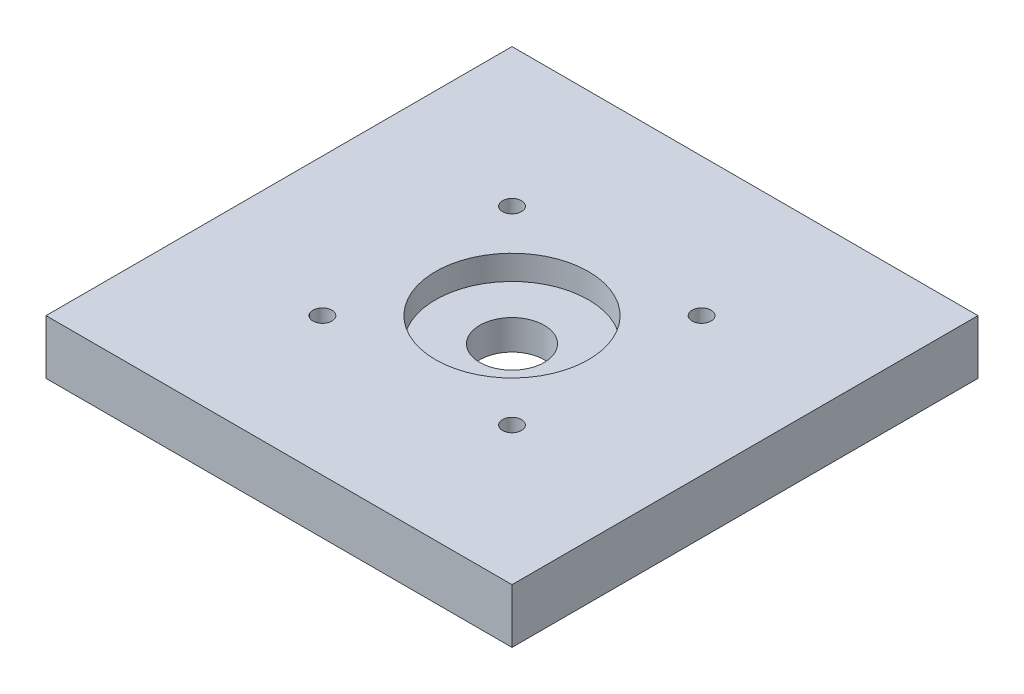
ISO-10303-21;
HEADER;
FILE_DESCRIPTION(('STEP AP214'),'2;1');
FILE_NAME('part.step','',(''),(''),'','','');
FILE_SCHEMA(('AUTOMOTIVE_DESIGN { 1 0 10303 214 1 1 1 1 }'));
ENDSEC;
DATA;
#1=APPLICATION_CONTEXT('core data for automotive mechanical design processes');
#2=APPLICATION_PROTOCOL_DEFINITION('international standard','automotive_design',2000,#1);
#3=PRODUCT_CONTEXT('',#1,'mechanical');
#4=PRODUCT('Part','Part','',(#3));
#5=PRODUCT_RELATED_PRODUCT_CATEGORY('part','',(#4));
#6=PRODUCT_DEFINITION_FORMATION('','',#4);
#7=PRODUCT_DEFINITION_CONTEXT('part definition',#1,'design');
#8=PRODUCT_DEFINITION('design','',#6,#7);
#9=PRODUCT_DEFINITION_SHAPE('','',#8);
#10=(LENGTH_UNIT() NAMED_UNIT(*) SI_UNIT(.MILLI.,.METRE.));
#11=(NAMED_UNIT(*) PLANE_ANGLE_UNIT() SI_UNIT($,.RADIAN.));
#12=(NAMED_UNIT(*) SI_UNIT($,.STERADIAN.) SOLID_ANGLE_UNIT());
#13=UNCERTAINTY_MEASURE_WITH_UNIT(LENGTH_MEASURE(1.E-05),#10,'distance_accuracy_value','');
#14=(GEOMETRIC_REPRESENTATION_CONTEXT(3) GLOBAL_UNCERTAINTY_ASSIGNED_CONTEXT((#13)) GLOBAL_UNIT_ASSIGNED_CONTEXT((#10,
#11,#12)) REPRESENTATION_CONTEXT('',''));
#15=CARTESIAN_POINT('',(0.,0.,0.));
#16=DIRECTION('',(0.,0.,1.));
#17=DIRECTION('',(1.,0.,0.));
#18=AXIS2_PLACEMENT_3D('',#15,#16,#17);
#19=CARTESIAN_POINT('',(0.,8.89,0.));
#20=DIRECTION('',(0.,-1.,0.));
#21=DIRECTION('',(0.,0.,-1.));
#22=AXIS2_PLACEMENT_3D('',#19,#20,#21);
#23=CYLINDRICAL_SURFACE('',#22,5.2705);
#24=CARTESIAN_POINT('',(0.,0.,0.));
#25=DIRECTION('',(0.,1.,0.));
#26=DIRECTION('',(0.,0.,1.));
#27=AXIS2_PLACEMENT_3D('',#24,#25,#26);
#28=CIRCLE('',#27,5.2705);
#29=CARTESIAN_POINT('',(0.,0.,5.27050000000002));
#30=VERTEX_POINT('',#29);
#31=EDGE_CURVE('E122',#30,#30,#28,.T.);
#32=ORIENTED_EDGE('',*,*,#31,.F.);
#33=EDGE_LOOP('',(#32));
#34=FACE_BOUND('',#33,.T.);
#35=CARTESIAN_POINT('',(0.,4.89,0.));
#36=DIRECTION('',(0.,1.,0.));
#37=DIRECTION('',(0.,0.,1.));
#38=AXIS2_PLACEMENT_3D('',#35,#36,#37);
#39=CIRCLE('',#38,5.2705);
#40=CARTESIAN_POINT('',(0.,4.89,5.27050000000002));
#41=VERTEX_POINT('',#40);
#42=EDGE_CURVE('E50',#41,#41,#39,.T.);
#43=ORIENTED_EDGE('',*,*,#42,.T.);
#44=EDGE_LOOP('',(#43));
#45=FACE_BOUND('',#44,.T.);
#46=ADVANCED_FACE('F47',(#34,#45),#23,.F.);
#47=CARTESIAN_POINT('',(38.1,8.89,0.));
#48=DIRECTION('',(1.,0.,0.));
#49=DIRECTION('',(0.,0.,-1.));
#50=AXIS2_PLACEMENT_3D('',#47,#48,#49);
#51=PLANE('',#50);
#52=DIRECTION('',(0.,0.,1.));
#53=VECTOR('',#52,1.);
#54=CARTESIAN_POINT('',(38.1,0.,0.));
#55=LINE('',#54,#53);
#56=CARTESIAN_POINT('',(38.1,0.,-38.1));
#57=VERTEX_POINT('',#56);
#58=CARTESIAN_POINT('',(38.1,0.,38.1));
#59=VERTEX_POINT('',#58);
#60=EDGE_CURVE('E142',#57,#59,#55,.T.);
#61=ORIENTED_EDGE('',*,*,#60,.F.);
#62=DIRECTION('',(0.,-1.,0.));
#63=VECTOR('',#62,1.);
#64=CARTESIAN_POINT('',(38.1,8.89,-38.1));
#65=LINE('',#64,#63);
#66=CARTESIAN_POINT('',(38.1,8.89,-38.1));
#67=VERTEX_POINT('',#66);
#68=EDGE_CURVE('E11',#67,#57,#65,.T.);
#69=ORIENTED_EDGE('',*,*,#68,.F.);
#70=DIRECTION('',(0.,0.,1.));
#71=VECTOR('',#70,1.);
#72=CARTESIAN_POINT('',(38.1,8.89,0.));
#73=LINE('',#72,#71);
#74=CARTESIAN_POINT('',(38.1,8.89,38.1));
#75=VERTEX_POINT('',#74);
#76=EDGE_CURVE('E112',#67,#75,#73,.T.);
#77=ORIENTED_EDGE('',*,*,#76,.T.);
#78=DIRECTION('',(0.,-1.,0.));
#79=VECTOR('',#78,1.);
#80=CARTESIAN_POINT('',(38.1,8.89,38.1));
#81=LINE('',#80,#79);
#82=EDGE_CURVE('E88',#75,#59,#81,.T.);
#83=ORIENTED_EDGE('',*,*,#82,.T.);
#84=EDGE_LOOP('',(#61,#69,#77,#83));
#85=FACE_BOUND('',#84,.T.);
#86=ADVANCED_FACE('F159',(#85),#51,.T.);
#87=CARTESIAN_POINT('',(0.,8.89,-38.1));
#88=DIRECTION('',(0.,0.,-1.));
#89=DIRECTION('',(-1.,0.,0.));
#90=AXIS2_PLACEMENT_3D('',#87,#88,#89);
#91=PLANE('',#90);
#92=DIRECTION('',(1.,0.,0.));
#93=VECTOR('',#92,1.);
#94=CARTESIAN_POINT('',(0.,0.,-38.1));
#95=LINE('',#94,#93);
#96=CARTESIAN_POINT('',(-38.1,0.,-38.1));
#97=VERTEX_POINT('',#96);
#98=EDGE_CURVE('E100',#97,#57,#95,.T.);
#99=ORIENTED_EDGE('',*,*,#98,.F.);
#100=DIRECTION('',(0.,-1.,0.));
#101=VECTOR('',#100,1.);
#102=CARTESIAN_POINT('',(-38.1,8.89,-38.1));
#103=LINE('',#102,#101);
#104=CARTESIAN_POINT('',(-38.1,8.89,-38.1));
#105=VERTEX_POINT('',#104);
#106=EDGE_CURVE('E57',#105,#97,#103,.T.);
#107=ORIENTED_EDGE('',*,*,#106,.F.);
#108=DIRECTION('',(1.,0.,0.));
#109=VECTOR('',#108,1.);
#110=CARTESIAN_POINT('',(0.,8.89,-38.1));
#111=LINE('',#110,#109);
#112=EDGE_CURVE('E98',#105,#67,#111,.T.);
#113=ORIENTED_EDGE('',*,*,#112,.T.);
#114=ORIENTED_EDGE('',*,*,#68,.T.);
#115=EDGE_LOOP('',(#99,#107,#113,#114));
#116=FACE_BOUND('',#115,.T.);
#117=ADVANCED_FACE('F96',(#116),#91,.T.);
#118=CARTESIAN_POINT('',(-38.1,8.89,0.));
#119=DIRECTION('',(1.,0.,0.));
#120=DIRECTION('',(0.,0.,-1.));
#121=AXIS2_PLACEMENT_3D('',#118,#119,#120);
#122=PLANE('',#121);
#123=DIRECTION('',(0.,0.,1.));
#124=VECTOR('',#123,1.);
#125=CARTESIAN_POINT('',(-38.1,0.,0.));
#126=LINE('',#125,#124);
#127=CARTESIAN_POINT('',(-38.1,0.,38.1));
#128=VERTEX_POINT('',#127);
#129=EDGE_CURVE('E147',#97,#128,#126,.T.);
#130=ORIENTED_EDGE('',*,*,#129,.T.);
#131=DIRECTION('',(0.,-1.,0.));
#132=VECTOR('',#131,1.);
#133=CARTESIAN_POINT('',(-38.1,8.89,38.1));
#134=LINE('',#133,#132);
#135=CARTESIAN_POINT('',(-38.1,8.89,38.1));
#136=VERTEX_POINT('',#135);
#137=EDGE_CURVE('E104',#136,#128,#134,.T.);
#138=ORIENTED_EDGE('',*,*,#137,.F.);
#139=DIRECTION('',(0.,0.,1.));
#140=VECTOR('',#139,1.);
#141=CARTESIAN_POINT('',(-38.1,8.89,0.));
#142=LINE('',#141,#140);
#143=EDGE_CURVE('E107',#105,#136,#142,.T.);
#144=ORIENTED_EDGE('',*,*,#143,.F.);
#145=ORIENTED_EDGE('',*,*,#106,.T.);
#146=EDGE_LOOP('',(#130,#138,#144,#145));
#147=FACE_BOUND('',#146,.T.);
#148=ADVANCED_FACE('F108',(#147),#122,.F.);
#149=CARTESIAN_POINT('',(-15.5,8.89,15.5));
#150=DIRECTION('',(0.,-1.,0.));
#151=DIRECTION('',(0.,0.,-1.));
#152=AXIS2_PLACEMENT_3D('',#149,#150,#151);
#153=CYLINDRICAL_SURFACE('',#152,1.55);
#154=CARTESIAN_POINT('',(-15.5,8.89,15.5));
#155=DIRECTION('',(0.,1.,0.));
#156=DIRECTION('',(0.,0.,1.));
#157=AXIS2_PLACEMENT_3D('',#154,#155,#156);
#158=CIRCLE('',#157,1.55);
#159=CARTESIAN_POINT('',(-15.5,8.89,17.05));
#160=VERTEX_POINT('',#159);
#161=EDGE_CURVE('E116',#160,#160,#158,.T.);
#162=ORIENTED_EDGE('',*,*,#161,.T.);
#163=EDGE_LOOP('',(#162));
#164=FACE_BOUND('',#163,.T.);
#165=CARTESIAN_POINT('',(-15.5,0.,15.5));
#166=DIRECTION('',(0.,1.,0.));
#167=DIRECTION('',(0.,0.,1.));
#168=AXIS2_PLACEMENT_3D('',#165,#166,#167);
#169=CIRCLE('',#168,1.55);
#170=CARTESIAN_POINT('',(-15.5,0.,17.05));
#171=VERTEX_POINT('',#170);
#172=EDGE_CURVE('E138',#171,#171,#169,.T.);
#173=ORIENTED_EDGE('',*,*,#172,.F.);
#174=EDGE_LOOP('',(#173));
#175=FACE_BOUND('',#174,.T.);
#176=ADVANCED_FACE('F170',(#164,#175),#153,.F.);
#177=CARTESIAN_POINT('',(15.5,8.89,15.5));
#178=DIRECTION('',(0.,-1.,0.));
#179=DIRECTION('',(0.,0.,-1.));
#180=AXIS2_PLACEMENT_3D('',#177,#178,#179);
#181=CYLINDRICAL_SURFACE('',#180,1.55);
#182=CARTESIAN_POINT('',(15.5,8.89,15.5));
#183=DIRECTION('',(0.,1.,0.));
#184=DIRECTION('',(0.,0.,1.));
#185=AXIS2_PLACEMENT_3D('',#182,#183,#184);
#186=CIRCLE('',#185,1.55);
#187=CARTESIAN_POINT('',(15.5,8.89,17.05));
#188=VERTEX_POINT('',#187);
#189=EDGE_CURVE('E299',#188,#188,#186,.T.);
#190=ORIENTED_EDGE('',*,*,#189,.T.);
#191=EDGE_LOOP('',(#190));
#192=FACE_BOUND('',#191,.T.);
#193=CARTESIAN_POINT('',(15.5,0.,15.5));
#194=DIRECTION('',(0.,1.,0.));
#195=DIRECTION('',(0.,0.,1.));
#196=AXIS2_PLACEMENT_3D('',#193,#194,#195);
#197=CIRCLE('',#196,1.55);
#198=CARTESIAN_POINT('',(15.5,0.,17.05));
#199=VERTEX_POINT('',#198);
#200=EDGE_CURVE('E134',#199,#199,#197,.T.);
#201=ORIENTED_EDGE('',*,*,#200,.F.);
#202=EDGE_LOOP('',(#201));
#203=FACE_BOUND('',#202,.T.);
#204=ADVANCED_FACE('F173',(#192,#203),#181,.F.);
#205=CARTESIAN_POINT('',(15.5,8.89,-15.5));
#206=DIRECTION('',(0.,-1.,0.));
#207=DIRECTION('',(0.,0.,-1.));
#208=AXIS2_PLACEMENT_3D('',#205,#206,#207);
#209=CYLINDRICAL_SURFACE('',#208,1.55);
#210=CARTESIAN_POINT('',(15.5,8.89,-15.5));
#211=DIRECTION('',(0.,1.,0.));
#212=DIRECTION('',(0.,0.,1.));
#213=AXIS2_PLACEMENT_3D('',#210,#211,#212);
#214=CIRCLE('',#213,1.55);
#215=CARTESIAN_POINT('',(15.5,8.89,-13.95));
#216=VERTEX_POINT('',#215);
#217=EDGE_CURVE('E295',#216,#216,#214,.T.);
#218=ORIENTED_EDGE('',*,*,#217,.T.);
#219=EDGE_LOOP('',(#218));
#220=FACE_BOUND('',#219,.T.);
#221=CARTESIAN_POINT('',(15.5,0.,-15.5));
#222=DIRECTION('',(0.,1.,0.));
#223=DIRECTION('',(0.,0.,1.));
#224=AXIS2_PLACEMENT_3D('',#221,#222,#223);
#225=CIRCLE('',#224,1.55);
#226=CARTESIAN_POINT('',(15.5,0.,-13.95));
#227=VERTEX_POINT('',#226);
#228=EDGE_CURVE('E130',#227,#227,#225,.T.);
#229=ORIENTED_EDGE('',*,*,#228,.F.);
#230=EDGE_LOOP('',(#229));
#231=FACE_BOUND('',#230,.T.);
#232=ADVANCED_FACE('F177',(#220,#231),#209,.F.);
#233=CARTESIAN_POINT('',(-15.5,8.89,-15.5));
#234=DIRECTION('',(0.,-1.,0.));
#235=DIRECTION('',(0.,0.,-1.));
#236=AXIS2_PLACEMENT_3D('',#233,#234,#235);
#237=CYLINDRICAL_SURFACE('',#236,1.55);
#238=CARTESIAN_POINT('',(-15.5,8.89,-15.5));
#239=DIRECTION('',(0.,1.,0.));
#240=DIRECTION('',(0.,0.,1.));
#241=AXIS2_PLACEMENT_3D('',#238,#239,#240);
#242=CIRCLE('',#241,1.55);
#243=CARTESIAN_POINT('',(-15.5,8.89,-13.95));
#244=VERTEX_POINT('',#243);
#245=EDGE_CURVE('E152',#244,#244,#242,.T.);
#246=ORIENTED_EDGE('',*,*,#245,.T.);
#247=EDGE_LOOP('',(#246));
#248=FACE_BOUND('',#247,.T.);
#249=CARTESIAN_POINT('',(-15.5,0.,-15.5));
#250=DIRECTION('',(0.,1.,0.));
#251=DIRECTION('',(0.,0.,1.));
#252=AXIS2_PLACEMENT_3D('',#249,#250,#251);
#253=CIRCLE('',#252,1.55);
#254=CARTESIAN_POINT('',(-15.5,0.,-13.95));
#255=VERTEX_POINT('',#254);
#256=EDGE_CURVE('E126',#255,#255,#253,.T.);
#257=ORIENTED_EDGE('',*,*,#256,.F.);
#258=EDGE_LOOP('',(#257));
#259=FACE_BOUND('',#258,.T.);
#260=ADVANCED_FACE('F180',(#248,#259),#237,.F.);
#261=CARTESIAN_POINT('',(0.,8.89,38.1));
#262=DIRECTION('',(0.,0.,-1.));
#263=DIRECTION('',(-1.,0.,0.));
#264=AXIS2_PLACEMENT_3D('',#261,#262,#263);
#265=PLANE('',#264);
#266=DIRECTION('',(1.,0.,0.));
#267=VECTOR('',#266,1.);
#268=CARTESIAN_POINT('',(0.,0.,38.1));
#269=LINE('',#268,#267);
#270=EDGE_CURVE('E81',#128,#59,#269,.T.);
#271=ORIENTED_EDGE('',*,*,#270,.T.);
#272=ORIENTED_EDGE('',*,*,#82,.F.);
#273=DIRECTION('',(1.,0.,0.));
#274=VECTOR('',#273,1.);
#275=CARTESIAN_POINT('',(0.,8.89,38.1));
#276=LINE('',#275,#274);
#277=EDGE_CURVE('E65',#136,#75,#276,.T.);
#278=ORIENTED_EDGE('',*,*,#277,.F.);
#279=ORIENTED_EDGE('',*,*,#137,.T.);
#280=EDGE_LOOP('',(#271,#272,#278,#279));
#281=FACE_BOUND('',#280,.T.);
#282=ADVANCED_FACE('F157',(#281),#265,.F.);
#283=CARTESIAN_POINT('',(0.,8.89,0.));
#284=DIRECTION('',(0.,1.,0.));
#285=DIRECTION('',(0.,0.,1.));
#286=AXIS2_PLACEMENT_3D('',#283,#284,#285);
#287=PLANE('',#286);
#288=CARTESIAN_POINT('',(0.,8.89,0.));
#289=DIRECTION('',(0.,1.,0.));
#290=DIRECTION('',(0.,0.,1.));
#291=AXIS2_PLACEMENT_3D('',#288,#289,#290);
#292=CIRCLE('',#291,12.5);
#293=CARTESIAN_POINT('',(0.,8.89,12.5));
#294=VERTEX_POINT('',#293);
#295=EDGE_CURVE('E286',#294,#294,#292,.T.);
#296=ORIENTED_EDGE('',*,*,#295,.F.);
#297=EDGE_LOOP('',(#296));
#298=FACE_BOUND('',#297,.T.);
#299=ORIENTED_EDGE('',*,*,#245,.F.);
#300=EDGE_LOOP('',(#299));
#301=FACE_BOUND('',#300,.T.);
#302=ORIENTED_EDGE('',*,*,#217,.F.);
#303=EDGE_LOOP('',(#302));
#304=FACE_BOUND('',#303,.T.);
#305=ORIENTED_EDGE('',*,*,#189,.F.);
#306=EDGE_LOOP('',(#305));
#307=FACE_BOUND('',#306,.T.);
#308=ORIENTED_EDGE('',*,*,#161,.F.);
#309=EDGE_LOOP('',(#308));
#310=FACE_BOUND('',#309,.T.);
#311=ORIENTED_EDGE('',*,*,#76,.F.);
#312=ORIENTED_EDGE('',*,*,#112,.F.);
#313=ORIENTED_EDGE('',*,*,#143,.T.);
#314=ORIENTED_EDGE('',*,*,#277,.T.);
#315=EDGE_LOOP('',(#311,#312,#313,#314));
#316=FACE_BOUND('',#315,.T.);
#317=ADVANCED_FACE('F111',(#298,#301,#304,#307,#310,#316),#287,.T.);
#318=CARTESIAN_POINT('',(0.,0.,0.));
#319=DIRECTION('',(0.,1.,0.));
#320=DIRECTION('',(0.,0.,1.));
#321=AXIS2_PLACEMENT_3D('',#318,#319,#320);
#322=PLANE('',#321);
#323=ORIENTED_EDGE('',*,*,#31,.T.);
#324=EDGE_LOOP('',(#323));
#325=FACE_BOUND('',#324,.T.);
#326=ORIENTED_EDGE('',*,*,#256,.T.);
#327=EDGE_LOOP('',(#326));
#328=FACE_BOUND('',#327,.T.);
#329=ORIENTED_EDGE('',*,*,#228,.T.);
#330=EDGE_LOOP('',(#329));
#331=FACE_BOUND('',#330,.T.);
#332=ORIENTED_EDGE('',*,*,#200,.T.);
#333=EDGE_LOOP('',(#332));
#334=FACE_BOUND('',#333,.T.);
#335=ORIENTED_EDGE('',*,*,#172,.T.);
#336=EDGE_LOOP('',(#335));
#337=FACE_BOUND('',#336,.T.);
#338=ORIENTED_EDGE('',*,*,#60,.T.);
#339=ORIENTED_EDGE('',*,*,#270,.F.);
#340=ORIENTED_EDGE('',*,*,#129,.F.);
#341=ORIENTED_EDGE('',*,*,#98,.T.);
#342=EDGE_LOOP('',(#338,#339,#340,#341));
#343=FACE_BOUND('',#342,.T.);
#344=ADVANCED_FACE('F158',(#325,#328,#331,#334,#337,#343),#322,.F.);
#345=CARTESIAN_POINT('',(0.,4.89,0.));
#346=DIRECTION('',(0.,1.,0.));
#347=DIRECTION('',(0.,0.,1.));
#348=AXIS2_PLACEMENT_3D('',#345,#346,#347);
#349=CYLINDRICAL_SURFACE('',#348,12.5);
#350=CARTESIAN_POINT('',(0.,4.89,0.));
#351=DIRECTION('',(0.,1.,0.));
#352=DIRECTION('',(0.,0.,1.));
#353=AXIS2_PLACEMENT_3D('',#350,#351,#352);
#354=CIRCLE('',#353,12.5);
#355=CARTESIAN_POINT('',(0.,4.89,12.5));
#356=VERTEX_POINT('',#355);
#357=EDGE_CURVE('E284',#356,#356,#354,.T.);
#358=ORIENTED_EDGE('',*,*,#357,.F.);
#359=EDGE_LOOP('',(#358));
#360=FACE_BOUND('',#359,.T.);
#361=ORIENTED_EDGE('',*,*,#295,.T.);
#362=EDGE_LOOP('',(#361));
#363=FACE_BOUND('',#362,.T.);
#364=ADVANCED_FACE('F195',(#360,#363),#349,.F.);
#365=CARTESIAN_POINT('',(0.,4.89,0.));
#366=DIRECTION('',(0.,1.,0.));
#367=DIRECTION('',(0.,0.,1.));
#368=AXIS2_PLACEMENT_3D('',#365,#366,#367);
#369=PLANE('',#368);
#370=ORIENTED_EDGE('',*,*,#42,.F.);
#371=EDGE_LOOP('',(#370));
#372=FACE_BOUND('',#371,.T.);
#373=ORIENTED_EDGE('',*,*,#357,.T.);
#374=EDGE_LOOP('',(#373));
#375=FACE_BOUND('',#374,.T.);
#376=ADVANCED_FACE('F209',(#372,#375),#369,.T.);
#377=CLOSED_SHELL('',(#46,#86,#117,#148,#176,#204,#232,#260,#282,#317,#344,#364,#376));
#378=MANIFOLD_SOLID_BREP('B2',#377);
#379=ADVANCED_BREP_SHAPE_REPRESENTATION('',(#18,#378),#14);
#380=SHAPE_DEFINITION_REPRESENTATION(#9,#379);
ENDSEC;
END-ISO-10303-21;
